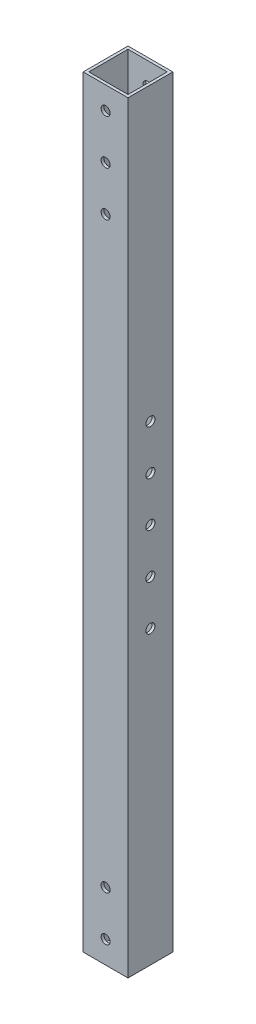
from build123d import *

# Parameters (mm, degrees)
SKETCH1_W                  = 25.4
SKETCH1_H                  = 25.4
SKETCH1_W_2                = 22.225
SKETCH1_H_2                = 22.225
BOSS_EXTRUDE1_DEPTH        = 431.8
F_7_0_201_DIAMETER_HOLE1_D = 5.1054
F_7_0_201_DIAMETER_HOLE2_D = 5.1054


with BuildPart() as part:
    # Sketch1 → Boss-Extrude1 (new body)
    with BuildSketch(Plane(origin=(0, 0, 0), x_dir=(1, 0, 0), z_dir=(0, 1, 0))):
        Rectangle(SKETCH1_W, SKETCH1_H)
        Rectangle(SKETCH1_W_2, SKETCH1_H_2, mode=Mode.SUBTRACT)
    extrude(amount=BOSS_EXTRUDE1_DEPTH)

    # 7 _0.201_ Diameter Hole1 (through all)
    with Locations(Plane.XY.offset(12.7)):
        with Locations((0, 12.7), (0, 38.1), (0, 368.3), (0, 393.7), (0, 419.1)):
            Hole(F_7_0_201_DIAMETER_HOLE1_D / 2)

    # 7 _0.201_ Diameter Hole2 (through all)
    with Locations(Plane(origin=(12.7, 0, 0), x_dir=(0, 0, -1), z_dir=(1, 0, 0))):
        with Locations((0, 165.1), (0, 190.5), (0, 215.9), (0, 241.3), (0, 266.7)):
            Hole(F_7_0_201_DIAMETER_HOLE2_D / 2)


solid = part.part
